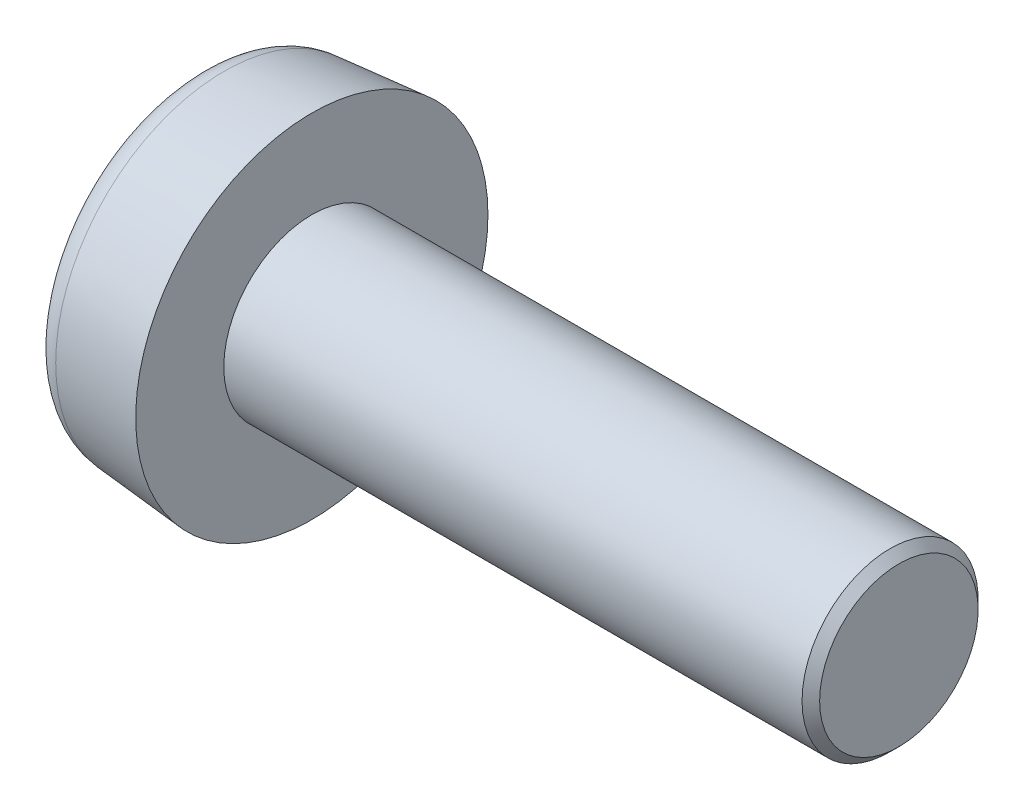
ISO-10303-21;
HEADER;
FILE_DESCRIPTION(('STEP AP214'),'2;1');
FILE_NAME('part.step','',(''),(''),'','','');
FILE_SCHEMA(('AUTOMOTIVE_DESIGN { 1 0 10303 214 1 1 1 1 }'));
ENDSEC;
DATA;
#1=APPLICATION_CONTEXT('core data for automotive mechanical design processes');
#2=APPLICATION_PROTOCOL_DEFINITION('international standard','automotive_design',2000,#1);
#3=PRODUCT_CONTEXT('',#1,'mechanical');
#4=PRODUCT('Part','Part','',(#3));
#5=PRODUCT_RELATED_PRODUCT_CATEGORY('part','',(#4));
#6=PRODUCT_DEFINITION_FORMATION('','',#4);
#7=PRODUCT_DEFINITION_CONTEXT('part definition',#1,'design');
#8=PRODUCT_DEFINITION('design','',#6,#7);
#9=PRODUCT_DEFINITION_SHAPE('','',#8);
#10=(LENGTH_UNIT() NAMED_UNIT(*) SI_UNIT(.MILLI.,.METRE.));
#11=(NAMED_UNIT(*) PLANE_ANGLE_UNIT() SI_UNIT($,.RADIAN.));
#12=(NAMED_UNIT(*) SI_UNIT($,.STERADIAN.) SOLID_ANGLE_UNIT());
#13=UNCERTAINTY_MEASURE_WITH_UNIT(LENGTH_MEASURE(1.E-05),#10,'distance_accuracy_value','');
#14=(GEOMETRIC_REPRESENTATION_CONTEXT(3) GLOBAL_UNCERTAINTY_ASSIGNED_CONTEXT((#13)) GLOBAL_UNIT_ASSIGNED_CONTEXT((#10,
#11,#12)) REPRESENTATION_CONTEXT('',''));
#15=CARTESIAN_POINT('',(0.,0.,0.));
#16=DIRECTION('',(0.,0.,1.));
#17=DIRECTION('',(1.,0.,0.));
#18=AXIS2_PLACEMENT_3D('',#15,#16,#17);
#19=CARTESIAN_POINT('',(0.,0.,0.));
#20=DIRECTION('',(1.,0.,0.));
#21=DIRECTION('',(0.,0.,-1.));
#22=AXIS2_PLACEMENT_3D('',#19,#20,#21);
#23=PLANE('',#22);
#24=CARTESIAN_POINT('',(0.,0.,0.));
#25=DIRECTION('',(1.,0.,0.));
#26=DIRECTION('',(0.,0.,-1.));
#27=AXIS2_PLACEMENT_3D('',#24,#25,#26);
#28=CIRCLE('',#27,4.74246303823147);
#29=CARTESIAN_POINT('',(0.,0.,-4.74246303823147));
#30=VERTEX_POINT('',#29);
#31=EDGE_CURVE('E136',#30,#30,#28,.F.);
#32=ORIENTED_EDGE('',*,*,#31,.T.);
#33=EDGE_LOOP('',(#32));
#34=FACE_BOUND('',#33,.T.);
#35=DIRECTION('',(0.,0.866025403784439,-0.5));
#36=VECTOR('',#35,1.);
#37=CARTESIAN_POINT('',(0.,-2.075,-1.19800180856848));
#38=LINE('',#37,#36);
#39=CARTESIAN_POINT('',(0.,-2.075,-1.19800180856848));
#40=VERTEX_POINT('',#39);
#41=CARTESIAN_POINT('',(0.,0.,-2.39600361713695));
#42=VERTEX_POINT('',#41);
#43=EDGE_CURVE('E52',#40,#42,#38,.T.);
#44=ORIENTED_EDGE('',*,*,#43,.T.);
#45=DIRECTION('',(0.,0.866025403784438,0.5));
#46=VECTOR('',#45,1.);
#47=CARTESIAN_POINT('',(0.,0.,-2.39600361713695));
#48=LINE('',#47,#46);
#49=CARTESIAN_POINT('',(0.,2.075,-1.19800180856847));
#50=VERTEX_POINT('',#49);
#51=EDGE_CURVE('E111',#42,#50,#48,.T.);
#52=ORIENTED_EDGE('',*,*,#51,.T.);
#53=DIRECTION('',(0.,0.,1.));
#54=VECTOR('',#53,1.);
#55=CARTESIAN_POINT('',(0.,2.075,-1.19800180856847));
#56=LINE('',#55,#54);
#57=CARTESIAN_POINT('',(0.,2.075,1.19800180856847));
#58=VERTEX_POINT('',#57);
#59=EDGE_CURVE('E109',#50,#58,#56,.T.);
#60=ORIENTED_EDGE('',*,*,#59,.T.);
#61=DIRECTION('',(0.,-0.866025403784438,0.5));
#62=VECTOR('',#61,1.);
#63=CARTESIAN_POINT('',(0.,2.075,1.19800180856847));
#64=LINE('',#63,#62);
#65=CARTESIAN_POINT('',(0.,0.,2.39600361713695));
#66=VERTEX_POINT('',#65);
#67=EDGE_CURVE('E88',#58,#66,#64,.T.);
#68=ORIENTED_EDGE('',*,*,#67,.T.);
#69=DIRECTION('',(0.,-0.866025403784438,-0.5));
#70=VECTOR('',#69,1.);
#71=CARTESIAN_POINT('',(0.,0.,2.39600361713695));
#72=LINE('',#71,#70);
#73=CARTESIAN_POINT('',(0.,-2.075,1.19800180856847));
#74=VERTEX_POINT('',#73);
#75=EDGE_CURVE('E99',#66,#74,#72,.T.);
#76=ORIENTED_EDGE('',*,*,#75,.T.);
#77=DIRECTION('',(0.,0.,-1.));
#78=VECTOR('',#77,1.);
#79=CARTESIAN_POINT('',(0.,-2.075,1.19800180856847));
#80=LINE('',#79,#78);
#81=EDGE_CURVE('E105',#74,#40,#80,.T.);
#82=ORIENTED_EDGE('',*,*,#81,.T.);
#83=EDGE_LOOP('',(#44,#52,#60,#68,#76,#82));
#84=FACE_BOUND('',#83,.T.);
#85=ADVANCED_FACE('F37',(#34,#84),#23,.F.);
#86=CARTESIAN_POINT('',(3.9,0.,0.));
#87=DIRECTION('',(1.,0.,0.));
#88=DIRECTION('',(0.,0.,-1.));
#89=AXIS2_PLACEMENT_3D('',#86,#87,#88);
#90=PLANE('',#89);
#91=CARTESIAN_POINT('',(3.9,0.,0.));
#92=DIRECTION('',(1.,0.,0.));
#93=DIRECTION('',(0.,0.,-1.));
#94=AXIS2_PLACEMENT_3D('',#91,#92,#93);
#95=CIRCLE('',#94,6.);
#96=CARTESIAN_POINT('',(3.9,0.,-6.));
#97=VERTEX_POINT('',#96);
#98=EDGE_CURVE('E129',#97,#97,#95,.T.);
#99=ORIENTED_EDGE('',*,*,#98,.T.);
#100=EDGE_LOOP('',(#99));
#101=FACE_BOUND('',#100,.T.);
#102=CARTESIAN_POINT('',(3.9,0.,0.));
#103=DIRECTION('',(1.,0.,0.));
#104=DIRECTION('',(0.,0.,-1.));
#105=AXIS2_PLACEMENT_3D('',#102,#103,#104);
#106=CIRCLE('',#105,3.);
#107=CARTESIAN_POINT('',(3.9,0.,-3.));
#108=VERTEX_POINT('',#107);
#109=EDGE_CURVE('E126',#108,#108,#106,.T.);
#110=ORIENTED_EDGE('',*,*,#109,.F.);
#111=EDGE_LOOP('',(#110));
#112=FACE_BOUND('',#111,.T.);
#113=ADVANCED_FACE('F153',(#101,#112),#90,.T.);
#114=CARTESIAN_POINT('',(3.9,0.,0.));
#115=DIRECTION('',(1.,0.,0.));
#116=DIRECTION('',(0.,0.,-1.));
#117=AXIS2_PLACEMENT_3D('',#114,#115,#116);
#118=CONICAL_SURFACE('',#117,6.,0.0872664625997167);
#119=CARTESIAN_POINT('',(0.912844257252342,0.,0.));
#120=DIRECTION('',(1.,0.,0.));
#121=DIRECTION('',(0.,0.,-1.));
#122=AXIS2_PLACEMENT_3D('',#119,#120,#121);
#123=CIRCLE('',#122,5.73865773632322);
#124=CARTESIAN_POINT('',(0.912844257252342,0.,-5.73865773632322));
#125=VERTEX_POINT('',#124);
#126=EDGE_CURVE('E133',#125,#125,#123,.T.);
#127=ORIENTED_EDGE('',*,*,#126,.T.);
#128=EDGE_LOOP('',(#127));
#129=FACE_BOUND('',#128,.T.);
#130=ORIENTED_EDGE('',*,*,#98,.F.);
#131=EDGE_LOOP('',(#130));
#132=FACE_BOUND('',#131,.T.);
#133=ADVANCED_FACE('F159',(#129,#132),#118,.T.);
#134=CARTESIAN_POINT('',(23.9,0.,0.));
#135=DIRECTION('',(-1.,0.,0.));
#136=DIRECTION('',(0.,0.,1.));
#137=AXIS2_PLACEMENT_3D('',#134,#135,#136);
#138=CYLINDRICAL_SURFACE('',#137,3.);
#139=CARTESIAN_POINT('',(23.6,0.,0.));
#140=DIRECTION('',(1.,0.,0.));
#141=DIRECTION('',(0.,0.,-1.));
#142=AXIS2_PLACEMENT_3D('',#139,#140,#141);
#143=CIRCLE('',#142,3.);
#144=CARTESIAN_POINT('',(23.6,0.,3.));
#145=VERTEX_POINT('',#144);
#146=EDGE_CURVE('E11',#145,#145,#143,.F.);
#147=ORIENTED_EDGE('',*,*,#146,.T.);
#148=EDGE_LOOP('',(#147));
#149=FACE_BOUND('',#148,.T.);
#150=ORIENTED_EDGE('',*,*,#109,.T.);
#151=EDGE_LOOP('',(#150));
#152=FACE_BOUND('',#151,.T.);
#153=ADVANCED_FACE('F163',(#149,#152),#138,.T.);
#154=CARTESIAN_POINT('',(23.9,0.,0.));
#155=DIRECTION('',(1.,0.,0.));
#156=DIRECTION('',(0.,0.,-1.));
#157=AXIS2_PLACEMENT_3D('',#154,#155,#156);
#158=PLANE('',#157);
#159=CARTESIAN_POINT('',(23.9,0.,0.));
#160=DIRECTION('',(1.,0.,0.));
#161=DIRECTION('',(0.,0.,-1.));
#162=AXIS2_PLACEMENT_3D('',#159,#160,#161);
#163=CIRCLE('',#162,2.69999999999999);
#164=CARTESIAN_POINT('',(23.9,0.,2.7));
#165=VERTEX_POINT('',#164);
#166=EDGE_CURVE('E45',#165,#165,#163,.T.);
#167=ORIENTED_EDGE('',*,*,#166,.T.);
#168=EDGE_LOOP('',(#167));
#169=FACE_BOUND('',#168,.T.);
#170=ADVANCED_FACE('F141',(#169),#158,.T.);
#171=CARTESIAN_POINT('',(2.,-2.075,-1.19800180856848));
#172=DIRECTION('',(0.,0.5,0.866025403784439));
#173=DIRECTION('',(0.,-0.866025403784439,0.5));
#174=AXIS2_PLACEMENT_3D('',#171,#172,#173);
#175=PLANE('',#174);
#176=ORIENTED_EDGE('',*,*,#43,.F.);
#177=DIRECTION('',(-1.,0.,0.));
#178=VECTOR('',#177,1.);
#179=CARTESIAN_POINT('',(2.,-2.075,-1.19800180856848));
#180=LINE('',#179,#178);
#181=CARTESIAN_POINT('',(2.,-2.075,-1.19800180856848));
#182=VERTEX_POINT('',#181);
#183=EDGE_CURVE('E117',#182,#40,#180,.T.);
#184=ORIENTED_EDGE('',*,*,#183,.F.);
#185=DIRECTION('',(0.,0.866025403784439,-0.5));
#186=VECTOR('',#185,1.);
#187=CARTESIAN_POINT('',(2.,-2.075,-1.19800180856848));
#188=LINE('',#187,#186);
#189=CARTESIAN_POINT('',(2.,0.,-2.39600361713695));
#190=VERTEX_POINT('',#189);
#191=EDGE_CURVE('E116',#182,#190,#188,.T.);
#192=ORIENTED_EDGE('',*,*,#191,.T.);
#193=DIRECTION('',(-1.,0.,0.));
#194=VECTOR('',#193,1.);
#195=CARTESIAN_POINT('',(2.,0.,-2.39600361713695));
#196=LINE('',#195,#194);
#197=EDGE_CURVE('E124',#190,#42,#196,.T.);
#198=ORIENTED_EDGE('',*,*,#197,.T.);
#199=EDGE_LOOP('',(#176,#184,#192,#198));
#200=FACE_BOUND('',#199,.T.);
#201=ADVANCED_FACE('F182',(#200),#175,.T.);
#202=CARTESIAN_POINT('',(2.,0.,-2.39600361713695));
#203=DIRECTION('',(0.,-0.5,0.866025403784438));
#204=DIRECTION('',(0.,-0.866025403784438,-0.5));
#205=AXIS2_PLACEMENT_3D('',#202,#203,#204);
#206=PLANE('',#205);
#207=ORIENTED_EDGE('',*,*,#51,.F.);
#208=ORIENTED_EDGE('',*,*,#197,.F.);
#209=DIRECTION('',(0.,0.866025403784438,0.5));
#210=VECTOR('',#209,1.);
#211=CARTESIAN_POINT('',(2.,0.,-2.39600361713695));
#212=LINE('',#211,#210);
#213=CARTESIAN_POINT('',(2.,2.075,-1.19800180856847));
#214=VERTEX_POINT('',#213);
#215=EDGE_CURVE('E255',#190,#214,#212,.T.);
#216=ORIENTED_EDGE('',*,*,#215,.T.);
#217=DIRECTION('',(-1.,0.,0.));
#218=VECTOR('',#217,1.);
#219=CARTESIAN_POINT('',(2.,2.075,-1.19800180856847));
#220=LINE('',#219,#218);
#221=EDGE_CURVE('E122',#214,#50,#220,.T.);
#222=ORIENTED_EDGE('',*,*,#221,.T.);
#223=EDGE_LOOP('',(#207,#208,#216,#222));
#224=FACE_BOUND('',#223,.T.);
#225=ADVANCED_FACE('F186',(#224),#206,.T.);
#226=CARTESIAN_POINT('',(2.,2.075,-1.19800180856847));
#227=DIRECTION('',(0.,-1.,0.));
#228=DIRECTION('',(0.,0.,-1.));
#229=AXIS2_PLACEMENT_3D('',#226,#227,#228);
#230=PLANE('',#229);
#231=ORIENTED_EDGE('',*,*,#59,.F.);
#232=ORIENTED_EDGE('',*,*,#221,.F.);
#233=DIRECTION('',(0.,0.,1.));
#234=VECTOR('',#233,1.);
#235=CARTESIAN_POINT('',(2.,2.075,-1.19800180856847));
#236=LINE('',#235,#234);
#237=CARTESIAN_POINT('',(2.,2.075,1.19800180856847));
#238=VERTEX_POINT('',#237);
#239=EDGE_CURVE('E61',#214,#238,#236,.T.);
#240=ORIENTED_EDGE('',*,*,#239,.T.);
#241=DIRECTION('',(-1.,0.,0.));
#242=VECTOR('',#241,1.);
#243=CARTESIAN_POINT('',(2.,2.075,1.19800180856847));
#244=LINE('',#243,#242);
#245=EDGE_CURVE('E95',#238,#58,#244,.T.);
#246=ORIENTED_EDGE('',*,*,#245,.T.);
#247=EDGE_LOOP('',(#231,#232,#240,#246));
#248=FACE_BOUND('',#247,.T.);
#249=ADVANCED_FACE('F191',(#248),#230,.T.);
#250=CARTESIAN_POINT('',(2.,2.075,1.19800180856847));
#251=DIRECTION('',(0.,-0.5,-0.866025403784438));
#252=DIRECTION('',(0.,0.866025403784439,-0.5));
#253=AXIS2_PLACEMENT_3D('',#250,#251,#252);
#254=PLANE('',#253);
#255=ORIENTED_EDGE('',*,*,#67,.F.);
#256=ORIENTED_EDGE('',*,*,#245,.F.);
#257=DIRECTION('',(0.,-0.866025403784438,0.5));
#258=VECTOR('',#257,1.);
#259=CARTESIAN_POINT('',(2.,2.075,1.19800180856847));
#260=LINE('',#259,#258);
#261=CARTESIAN_POINT('',(2.,0.,2.39600361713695));
#262=VERTEX_POINT('',#261);
#263=EDGE_CURVE('E92',#238,#262,#260,.T.);
#264=ORIENTED_EDGE('',*,*,#263,.T.);
#265=DIRECTION('',(-1.,0.,0.));
#266=VECTOR('',#265,1.);
#267=CARTESIAN_POINT('',(2.,0.,2.39600361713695));
#268=LINE('',#267,#266);
#269=EDGE_CURVE('E83',#262,#66,#268,.T.);
#270=ORIENTED_EDGE('',*,*,#269,.T.);
#271=EDGE_LOOP('',(#255,#256,#264,#270));
#272=FACE_BOUND('',#271,.T.);
#273=ADVANCED_FACE('F85',(#272),#254,.T.);
#274=CARTESIAN_POINT('',(2.,0.,2.39600361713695));
#275=DIRECTION('',(0.,0.5,-0.866025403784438));
#276=DIRECTION('',(0.,0.866025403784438,0.5));
#277=AXIS2_PLACEMENT_3D('',#274,#275,#276);
#278=PLANE('',#277);
#279=ORIENTED_EDGE('',*,*,#75,.F.);
#280=ORIENTED_EDGE('',*,*,#269,.F.);
#281=DIRECTION('',(0.,-0.866025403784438,-0.5));
#282=VECTOR('',#281,1.);
#283=CARTESIAN_POINT('',(2.,0.,2.39600361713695));
#284=LINE('',#283,#282);
#285=CARTESIAN_POINT('',(2.,-2.075,1.19800180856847));
#286=VERTEX_POINT('',#285);
#287=EDGE_CURVE('E230',#262,#286,#284,.T.);
#288=ORIENTED_EDGE('',*,*,#287,.T.);
#289=DIRECTION('',(-1.,0.,0.));
#290=VECTOR('',#289,1.);
#291=CARTESIAN_POINT('',(2.,-2.075,1.19800180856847));
#292=LINE('',#291,#290);
#293=EDGE_CURVE('E96',#286,#74,#292,.T.);
#294=ORIENTED_EDGE('',*,*,#293,.T.);
#295=EDGE_LOOP('',(#279,#280,#288,#294));
#296=FACE_BOUND('',#295,.T.);
#297=ADVANCED_FACE('F100',(#296),#278,.T.);
#298=CARTESIAN_POINT('',(2.,-2.075,1.19800180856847));
#299=DIRECTION('',(0.,1.,0.));
#300=DIRECTION('',(0.,0.,1.));
#301=AXIS2_PLACEMENT_3D('',#298,#299,#300);
#302=PLANE('',#301);
#303=ORIENTED_EDGE('',*,*,#81,.F.);
#304=ORIENTED_EDGE('',*,*,#293,.F.);
#305=DIRECTION('',(0.,0.,-1.));
#306=VECTOR('',#305,1.);
#307=CARTESIAN_POINT('',(2.,-2.075,1.19800180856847));
#308=LINE('',#307,#306);
#309=EDGE_CURVE('E119',#286,#182,#308,.T.);
#310=ORIENTED_EDGE('',*,*,#309,.T.);
#311=ORIENTED_EDGE('',*,*,#183,.T.);
#312=EDGE_LOOP('',(#303,#304,#310,#311));
#313=FACE_BOUND('',#312,.T.);
#314=ADVANCED_FACE('F200',(#313),#302,.T.);
#315=CARTESIAN_POINT('',(2.,0.,2.39600361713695));
#316=DIRECTION('',(0.86602540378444,-0.249999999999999,0.433012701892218));
#317=DIRECTION('',(0.447213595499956,0.,-0.894427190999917));
#318=AXIS2_PLACEMENT_3D('',#315,#316,#317);
#319=PLANE('',#318);
#320=ORIENTED_EDGE('',*,*,#287,.F.);
#321=DIRECTION('',(-0.447213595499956,0.,0.894427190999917));
#322=VECTOR('',#321,1.);
#323=CARTESIAN_POINT('',(2.,0.,2.39600361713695));
#324=LINE('',#323,#322);
#325=CARTESIAN_POINT('',(3.19800180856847,0.,0.));
#326=VERTEX_POINT('',#325);
#327=EDGE_CURVE('E232',#326,#262,#324,.T.);
#328=ORIENTED_EDGE('',*,*,#327,.F.);
#329=DIRECTION('',(-0.447213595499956,-0.774596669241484,0.447213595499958));
#330=VECTOR('',#329,1.);
#331=CARTESIAN_POINT('',(2.,-2.075,1.19800180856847));
#332=LINE('',#331,#330);
#333=EDGE_CURVE('E235',#326,#286,#332,.T.);
#334=ORIENTED_EDGE('',*,*,#333,.T.);
#335=EDGE_LOOP('',(#320,#328,#334));
#336=FACE_BOUND('',#335,.T.);
#337=ADVANCED_FACE('F203',(#336),#319,.F.);
#338=CARTESIAN_POINT('',(2.,-2.075,1.19800180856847));
#339=DIRECTION('',(0.86602540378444,-0.499999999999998,0.));
#340=DIRECTION('',(0.499999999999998,0.86602540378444,0.));
#341=AXIS2_PLACEMENT_3D('',#338,#339,#340);
#342=PLANE('',#341);
#343=ORIENTED_EDGE('',*,*,#309,.F.);
#344=ORIENTED_EDGE('',*,*,#333,.F.);
#345=DIRECTION('',(-0.447213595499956,-0.774596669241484,-0.447213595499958));
#346=VECTOR('',#345,1.);
#347=CARTESIAN_POINT('',(2.,-2.075,-1.19800180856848));
#348=LINE('',#347,#346);
#349=EDGE_CURVE('E259',#326,#182,#348,.T.);
#350=ORIENTED_EDGE('',*,*,#349,.T.);
#351=EDGE_LOOP('',(#343,#344,#350));
#352=FACE_BOUND('',#351,.T.);
#353=ADVANCED_FACE('F205',(#352),#342,.F.);
#354=CARTESIAN_POINT('',(2.,-2.075,-1.19800180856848));
#355=DIRECTION('',(0.86602540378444,-0.249999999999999,-0.433012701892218));
#356=DIRECTION('',(-0.447213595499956,0.,-0.894427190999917));
#357=AXIS2_PLACEMENT_3D('',#354,#355,#356);
#358=PLANE('',#357);
#359=ORIENTED_EDGE('',*,*,#191,.F.);
#360=ORIENTED_EDGE('',*,*,#349,.F.);
#361=DIRECTION('',(-0.447213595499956,0.,-0.894427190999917));
#362=VECTOR('',#361,1.);
#363=CARTESIAN_POINT('',(2.,0.,-2.39600361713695));
#364=LINE('',#363,#362);
#365=EDGE_CURVE('E267',#326,#190,#364,.T.);
#366=ORIENTED_EDGE('',*,*,#365,.T.);
#367=EDGE_LOOP('',(#359,#360,#366));
#368=FACE_BOUND('',#367,.T.);
#369=ADVANCED_FACE('F208',(#368),#358,.F.);
#370=CARTESIAN_POINT('',(2.,0.,-2.39600361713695));
#371=DIRECTION('',(0.86602540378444,0.249999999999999,-0.433012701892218));
#372=DIRECTION('',(-0.447213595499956,0.,-0.894427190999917));
#373=AXIS2_PLACEMENT_3D('',#370,#371,#372);
#374=PLANE('',#373);
#375=ORIENTED_EDGE('',*,*,#215,.F.);
#376=ORIENTED_EDGE('',*,*,#365,.F.);
#377=DIRECTION('',(-0.447213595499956,0.774596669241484,-0.447213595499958));
#378=VECTOR('',#377,1.);
#379=CARTESIAN_POINT('',(2.,2.075,-1.19800180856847));
#380=LINE('',#379,#378);
#381=EDGE_CURVE('E269',#326,#214,#380,.T.);
#382=ORIENTED_EDGE('',*,*,#381,.T.);
#383=EDGE_LOOP('',(#375,#376,#382));
#384=FACE_BOUND('',#383,.T.);
#385=ADVANCED_FACE('F212',(#384),#374,.F.);
#386=CARTESIAN_POINT('',(2.,2.075,-1.19800180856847));
#387=DIRECTION('',(0.86602540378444,0.499999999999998,0.));
#388=DIRECTION('',(-0.499999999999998,0.86602540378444,0.));
#389=AXIS2_PLACEMENT_3D('',#386,#387,#388);
#390=PLANE('',#389);
#391=ORIENTED_EDGE('',*,*,#239,.F.);
#392=ORIENTED_EDGE('',*,*,#381,.F.);
#393=DIRECTION('',(-0.447213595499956,0.774596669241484,0.447213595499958));
#394=VECTOR('',#393,1.);
#395=CARTESIAN_POINT('',(2.,2.075,1.19800180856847));
#396=LINE('',#395,#394);
#397=EDGE_CURVE('E263',#326,#238,#396,.T.);
#398=ORIENTED_EDGE('',*,*,#397,.T.);
#399=EDGE_LOOP('',(#391,#392,#398));
#400=FACE_BOUND('',#399,.T.);
#401=ADVANCED_FACE('F216',(#400),#390,.F.);
#402=CARTESIAN_POINT('',(2.,2.075,1.19800180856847));
#403=DIRECTION('',(0.86602540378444,0.249999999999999,0.433012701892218));
#404=DIRECTION('',(0.447213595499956,0.,-0.894427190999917));
#405=AXIS2_PLACEMENT_3D('',#402,#403,#404);
#406=PLANE('',#405);
#407=ORIENTED_EDGE('',*,*,#263,.F.);
#408=ORIENTED_EDGE('',*,*,#397,.F.);
#409=ORIENTED_EDGE('',*,*,#327,.T.);
#410=EDGE_LOOP('',(#407,#408,#409));
#411=FACE_BOUND('',#410,.T.);
#412=ADVANCED_FACE('F149',(#411),#406,.F.);
#413=CARTESIAN_POINT('',(1.,0.,0.));
#414=DIRECTION('',(1.,0.,0.));
#415=DIRECTION('',(0.,0.,-1.));
#416=AXIS2_PLACEMENT_3D('',#413,#414,#415);
#417=TOROIDAL_SURFACE('',#416,4.74246303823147,1.);
#418=ORIENTED_EDGE('',*,*,#31,.F.);
#419=EDGE_LOOP('',(#418));
#420=FACE_BOUND('',#419,.T.);
#421=ORIENTED_EDGE('',*,*,#126,.F.);
#422=EDGE_LOOP('',(#421));
#423=FACE_BOUND('',#422,.T.);
#424=ADVANCED_FACE('F144',(#420,#423),#417,.T.);
#425=CARTESIAN_POINT('',(23.9,0.,0.));
#426=DIRECTION('',(-1.,0.,0.));
#427=DIRECTION('',(0.,0.,1.));
#428=AXIS2_PLACEMENT_3D('',#425,#426,#427);
#429=CONICAL_SURFACE('',#428,2.69999999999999,0.78539816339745);
#430=CARTESIAN_POINT('',(23.6,0.,3.));
#431=CARTESIAN_POINT('',(23.603125,0.,2.996875));
#432=CARTESIAN_POINT('',(23.60625,0.,2.99375));
#433=CARTESIAN_POINT('',(23.6125,0.,2.9875));
#434=CARTESIAN_POINT('',(23.615625,0.,2.984375));
#435=CARTESIAN_POINT('',(23.621875,0.,2.978125));
#436=CARTESIAN_POINT('',(23.625,0.,2.975));
#437=CARTESIAN_POINT('',(23.63125,0.,2.96875));
#438=CARTESIAN_POINT('',(23.634375,0.,2.965625));
#439=CARTESIAN_POINT('',(23.640625,0.,2.959375));
#440=CARTESIAN_POINT('',(23.64375,0.,2.95625));
#441=CARTESIAN_POINT('',(23.65,0.,2.95));
#442=CARTESIAN_POINT('',(23.653125,0.,2.946875));
#443=CARTESIAN_POINT('',(23.659375,0.,2.940625));
#444=CARTESIAN_POINT('',(23.6625,0.,2.9375));
#445=CARTESIAN_POINT('',(23.66875,0.,2.93125));
#446=CARTESIAN_POINT('',(23.671875,0.,2.928125));
#447=CARTESIAN_POINT('',(23.678125,0.,2.921875));
#448=CARTESIAN_POINT('',(23.68125,0.,2.91875));
#449=CARTESIAN_POINT('',(23.6875,0.,2.9125));
#450=CARTESIAN_POINT('',(23.690625,0.,2.909375));
#451=CARTESIAN_POINT('',(23.696875,0.,2.903125));
#452=CARTESIAN_POINT('',(23.7,0.,2.9));
#453=CARTESIAN_POINT('',(23.70625,0.,2.89375));
#454=CARTESIAN_POINT('',(23.709375,0.,2.890625));
#455=CARTESIAN_POINT('',(23.715625,0.,2.884375));
#456=CARTESIAN_POINT('',(23.71875,0.,2.88125));
#457=CARTESIAN_POINT('',(23.725,0.,2.875));
#458=CARTESIAN_POINT('',(23.728125,0.,2.871875));
#459=CARTESIAN_POINT('',(23.734375,0.,2.865625));
#460=CARTESIAN_POINT('',(23.7375,0.,2.8625));
#461=CARTESIAN_POINT('',(23.74375,0.,2.85625));
#462=CARTESIAN_POINT('',(23.746875,0.,2.853125));
#463=CARTESIAN_POINT('',(23.753125,0.,2.846875));
#464=CARTESIAN_POINT('',(23.75625,0.,2.84375));
#465=CARTESIAN_POINT('',(23.7625,0.,2.8375));
#466=CARTESIAN_POINT('',(23.765625,0.,2.834375));
#467=CARTESIAN_POINT('',(23.771875,0.,2.828125));
#468=CARTESIAN_POINT('',(23.775,0.,2.825));
#469=CARTESIAN_POINT('',(23.78125,0.,2.81875));
#470=CARTESIAN_POINT('',(23.784375,0.,2.815625));
#471=CARTESIAN_POINT('',(23.790625,0.,2.809375));
#472=CARTESIAN_POINT('',(23.79375,0.,2.80625));
#473=CARTESIAN_POINT('',(23.8,0.,2.8));
#474=CARTESIAN_POINT('',(23.803125,0.,2.796875));
#475=CARTESIAN_POINT('',(23.809375,0.,2.790625));
#476=CARTESIAN_POINT('',(23.8125,0.,2.7875));
#477=CARTESIAN_POINT('',(23.81875,0.,2.78125));
#478=CARTESIAN_POINT('',(23.821875,0.,2.778125));
#479=CARTESIAN_POINT('',(23.828125,0.,2.771875));
#480=CARTESIAN_POINT('',(23.83125,0.,2.76875));
#481=CARTESIAN_POINT('',(23.8375,0.,2.7625));
#482=CARTESIAN_POINT('',(23.840625,0.,2.759375));
#483=CARTESIAN_POINT('',(23.846875,0.,2.753125));
#484=CARTESIAN_POINT('',(23.85,0.,2.75));
#485=CARTESIAN_POINT('',(23.85625,0.,2.74375));
#486=CARTESIAN_POINT('',(23.859375,0.,2.740625));
#487=CARTESIAN_POINT('',(23.865625,0.,2.734375));
#488=CARTESIAN_POINT('',(23.86875,0.,2.73125));
#489=CARTESIAN_POINT('',(23.875,0.,2.725));
#490=CARTESIAN_POINT('',(23.878125,0.,2.721875));
#491=CARTESIAN_POINT('',(23.884375,0.,2.715625));
#492=CARTESIAN_POINT('',(23.8875,0.,2.7125));
#493=CARTESIAN_POINT('',(23.89375,0.,2.70625));
#494=CARTESIAN_POINT('',(23.896875,0.,2.703125));
#495=CARTESIAN_POINT('',(23.9,0.,2.7));
#496=B_SPLINE_CURVE_WITH_KNOTS('',3,(#430,#431,#432,#433,#434,#435,#436,#437,#438,#439,#440,
#441,#442,#443,#444,#445,#446,#447,#448,#449,#450,#451,#452,#453,#454,#455,#456,#457,#458,#459,
#460,#461,#462,#463,#464,#465,#466,#467,#468,#469,#470,#471,#472,#473,#474,#475,#476,#477,#478,
#479,#480,#481,#482,#483,#484,#485,#486,#487,#488,#489,#490,#491,#492,#493,#494,#495),
.UNSPECIFIED.,.F.,.F.,(4,2,2,2,2,2,2,2,2,2,2,2,2,2,2,2,2,2,2,2,2,2,2,2,2,2,2,2,2,2,2,2,4),(0.,
0.0132582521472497,0.0265165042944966,0.0397747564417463,0.0530330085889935,0.0662912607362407,
0.0795495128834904,0.0928077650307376,0.106066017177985,0.119324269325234,0.132582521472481,
0.145840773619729,0.159099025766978,0.172357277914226,0.185615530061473,0.198873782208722,
0.212132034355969,0.225390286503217,0.238648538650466,0.251906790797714,0.265165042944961,
0.27842329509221,0.291681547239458,0.304939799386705,0.318198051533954,0.331456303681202,
0.344714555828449,0.357972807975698,0.371231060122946,0.384489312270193,0.397747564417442,
0.41100581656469,0.424264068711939),.UNSPECIFIED.);
#497=EDGE_CURVE('BSEAM39',#145,#165,#496,.T.);
#498=ORIENTED_EDGE('',*,*,#146,.F.);
#499=ORIENTED_EDGE('',*,*,#166,.F.);
#500=ORIENTED_EDGE('',*,*,#497,.T.);
#501=ORIENTED_EDGE('',*,*,#497,.F.);
#502=EDGE_LOOP('',(#498,#500,#499,#501));
#503=FACE_BOUND('',#502,.T.);
#504=ADVANCED_FACE('F39',(#503),#429,.T.);
#505=CLOSED_SHELL('',(#85,#113,#133,#153,#170,#201,#225,#249,#273,#297,#314,#337,#353,#369,#385,
#401,#412,#424,#504));
#506=MANIFOLD_SOLID_BREP('B2',#505);
#507=ADVANCED_BREP_SHAPE_REPRESENTATION('',(#18,#506),#14);
#508=SHAPE_DEFINITION_REPRESENTATION(#9,#507);
ENDSEC;
END-ISO-10303-21;
